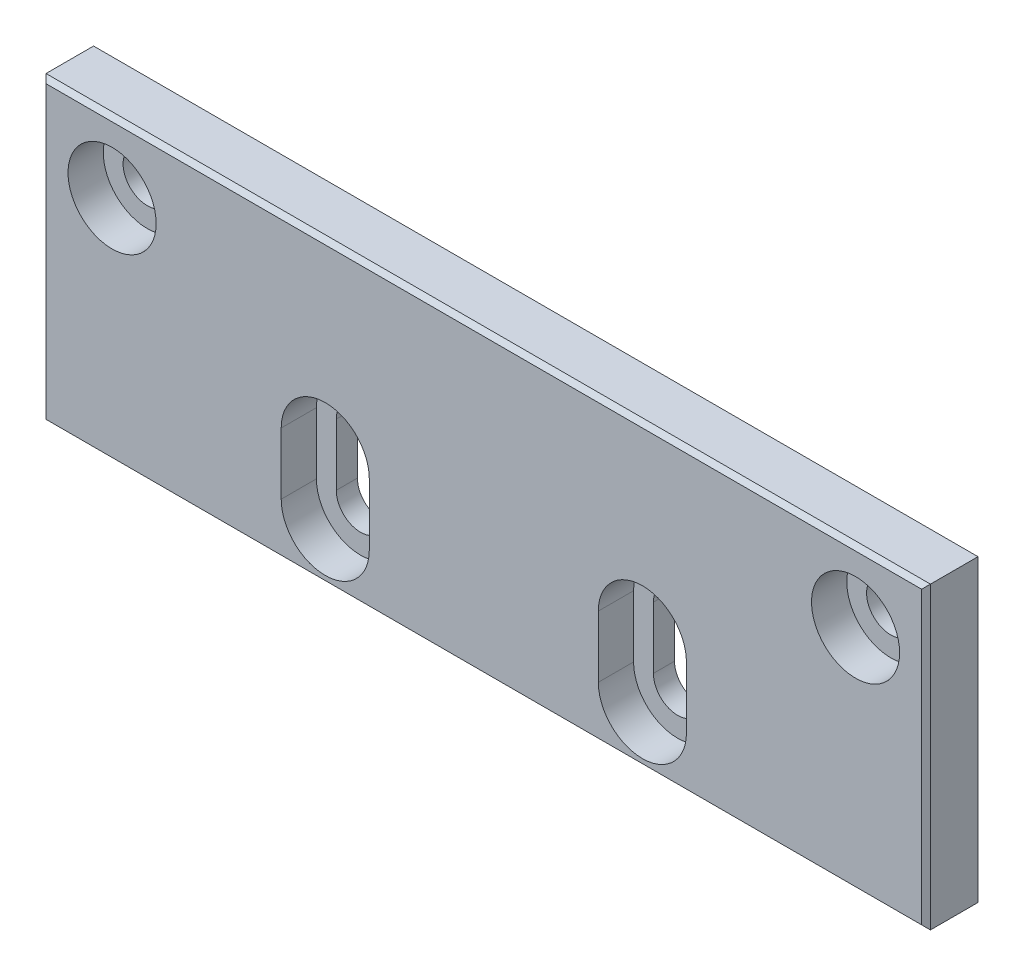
ISO-10303-21;
HEADER;
FILE_DESCRIPTION(('STEP AP214'),'2;1');
FILE_NAME('part.step','',(''),(''),'','','');
FILE_SCHEMA(('AUTOMOTIVE_DESIGN { 1 0 10303 214 1 1 1 1 }'));
ENDSEC;
DATA;
#1=APPLICATION_CONTEXT('core data for automotive mechanical design processes');
#2=APPLICATION_PROTOCOL_DEFINITION('international standard','automotive_design',2000,#1);
#3=PRODUCT_CONTEXT('',#1,'mechanical');
#4=PRODUCT('Part','Part','',(#3));
#5=PRODUCT_RELATED_PRODUCT_CATEGORY('part','',(#4));
#6=PRODUCT_DEFINITION_FORMATION('','',#4);
#7=PRODUCT_DEFINITION_CONTEXT('part definition',#1,'design');
#8=PRODUCT_DEFINITION('design','',#6,#7);
#9=PRODUCT_DEFINITION_SHAPE('','',#8);
#10=(LENGTH_UNIT() NAMED_UNIT(*) SI_UNIT(.MILLI.,.METRE.));
#11=(NAMED_UNIT(*) PLANE_ANGLE_UNIT() SI_UNIT($,.RADIAN.));
#12=(NAMED_UNIT(*) SI_UNIT($,.STERADIAN.) SOLID_ANGLE_UNIT());
#13=UNCERTAINTY_MEASURE_WITH_UNIT(LENGTH_MEASURE(1.E-05),#10,'distance_accuracy_value','');
#14=(GEOMETRIC_REPRESENTATION_CONTEXT(3) GLOBAL_UNCERTAINTY_ASSIGNED_CONTEXT((#13)) GLOBAL_UNIT_ASSIGNED_CONTEXT((#10,
#11,#12)) REPRESENTATION_CONTEXT('',''));
#15=CARTESIAN_POINT('',(0.,0.,0.));
#16=DIRECTION('',(0.,0.,1.));
#17=DIRECTION('',(1.,0.,0.));
#18=AXIS2_PLACEMENT_3D('',#15,#16,#17);
#19=CARTESIAN_POINT('',(50.2,-45.,6.4));
#20=DIRECTION('',(-1.,0.,0.));
#21=DIRECTION('',(0.,0.,1.));
#22=AXIS2_PLACEMENT_3D('',#19,#20,#21);
#23=PLANE('',#22);
#24=DIRECTION('',(0.,0.,-1.));
#25=VECTOR('',#24,1.);
#26=CARTESIAN_POINT('',(50.2,-45.,6.4));
#27=LINE('',#26,#25);
#28=CARTESIAN_POINT('',(50.2,-45.,5.90000000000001));
#29=VERTEX_POINT('',#28);
#30=CARTESIAN_POINT('',(50.2,-45.,0.5));
#31=VERTEX_POINT('',#30);
#32=EDGE_CURVE('E366',#29,#31,#27,.T.);
#33=ORIENTED_EDGE('',*,*,#32,.T.);
#34=DIRECTION('',(0.,1.,0.));
#35=VECTOR('',#34,1.);
#36=CARTESIAN_POINT('',(50.2,-45.,0.5));
#37=LINE('',#36,#35);
#38=CARTESIAN_POINT('',(50.2,-11.,0.5));
#39=VERTEX_POINT('',#38);
#40=EDGE_CURVE('E403',#31,#39,#37,.T.);
#41=ORIENTED_EDGE('',*,*,#40,.T.);
#42=DIRECTION('',(0.,0.,-1.));
#43=VECTOR('',#42,1.);
#44=CARTESIAN_POINT('',(50.2,-11.,6.4));
#45=LINE('',#44,#43);
#46=CARTESIAN_POINT('',(50.2,-11.,5.90000000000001));
#47=VERTEX_POINT('',#46);
#48=EDGE_CURVE('E375',#47,#39,#45,.T.);
#49=ORIENTED_EDGE('',*,*,#48,.F.);
#50=DIRECTION('',(0.,-1.,0.));
#51=VECTOR('',#50,1.);
#52=CARTESIAN_POINT('',(50.2,-45.,5.90000000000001));
#53=LINE('',#52,#51);
#54=EDGE_CURVE('E401',#47,#29,#53,.T.);
#55=ORIENTED_EDGE('',*,*,#54,.T.);
#56=EDGE_LOOP('',(#33,#41,#49,#55));
#57=FACE_BOUND('',#56,.T.);
#58=ADVANCED_FACE('F30',(#57),#23,.F.);
#59=CARTESIAN_POINT('',(50.2,-11.,6.4));
#60=DIRECTION('',(0.,-1.,0.));
#61=DIRECTION('',(0.,0.,-1.));
#62=AXIS2_PLACEMENT_3D('',#59,#60,#61);
#63=PLANE('',#62);
#64=ORIENTED_EDGE('',*,*,#48,.T.);
#65=DIRECTION('',(-1.,0.,0.));
#66=VECTOR('',#65,1.);
#67=CARTESIAN_POINT('',(50.2,-11.,0.5));
#68=LINE('',#67,#66);
#69=CARTESIAN_POINT('',(-50.2,-11.,0.5));
#70=VERTEX_POINT('',#69);
#71=EDGE_CURVE('E380',#39,#70,#68,.T.);
#72=ORIENTED_EDGE('',*,*,#71,.T.);
#73=DIRECTION('',(0.,0.,-1.));
#74=VECTOR('',#73,1.);
#75=CARTESIAN_POINT('',(-50.2,-11.,6.4));
#76=LINE('',#75,#74);
#77=CARTESIAN_POINT('',(-50.2,-11.,5.90000000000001));
#78=VERTEX_POINT('',#77);
#79=EDGE_CURVE('E372',#78,#70,#76,.T.);
#80=ORIENTED_EDGE('',*,*,#79,.F.);
#81=DIRECTION('',(1.,0.,0.));
#82=VECTOR('',#81,1.);
#83=CARTESIAN_POINT('',(50.2,-11.,5.90000000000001));
#84=LINE('',#83,#82);
#85=EDGE_CURVE('E378',#78,#47,#84,.T.);
#86=ORIENTED_EDGE('',*,*,#85,.T.);
#87=EDGE_LOOP('',(#64,#72,#80,#86));
#88=FACE_BOUND('',#87,.T.);
#89=ADVANCED_FACE('F433',(#88),#63,.F.);
#90=CARTESIAN_POINT('',(-50.2,-45.,6.4));
#91=DIRECTION('',(1.,0.,0.));
#92=DIRECTION('',(0.,0.,-1.));
#93=AXIS2_PLACEMENT_3D('',#90,#91,#92);
#94=PLANE('',#93);
#95=ORIENTED_EDGE('',*,*,#79,.T.);
#96=DIRECTION('',(0.,-1.,0.));
#97=VECTOR('',#96,1.);
#98=CARTESIAN_POINT('',(-50.2,-45.,0.5));
#99=LINE('',#98,#97);
#100=CARTESIAN_POINT('',(-50.2,-45.,0.5));
#101=VERTEX_POINT('',#100);
#102=EDGE_CURVE('E394',#70,#101,#99,.T.);
#103=ORIENTED_EDGE('',*,*,#102,.T.);
#104=DIRECTION('',(0.,0.,-1.));
#105=VECTOR('',#104,1.);
#106=CARTESIAN_POINT('',(-50.2,-45.,6.4));
#107=LINE('',#106,#105);
#108=CARTESIAN_POINT('',(-50.2,-45.,5.90000000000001));
#109=VERTEX_POINT('',#108);
#110=EDGE_CURVE('E369',#109,#101,#107,.T.);
#111=ORIENTED_EDGE('',*,*,#110,.F.);
#112=DIRECTION('',(0.,1.,0.));
#113=VECTOR('',#112,1.);
#114=CARTESIAN_POINT('',(-50.2,-11.,5.90000000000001));
#115=LINE('',#114,#113);
#116=EDGE_CURVE('E392',#109,#78,#115,.T.);
#117=ORIENTED_EDGE('',*,*,#116,.T.);
#118=EDGE_LOOP('',(#95,#103,#111,#117));
#119=FACE_BOUND('',#118,.T.);
#120=ADVANCED_FACE('F449',(#119),#94,.F.);
#121=CARTESIAN_POINT('',(50.2,-45.,6.4));
#122=DIRECTION('',(0.,1.,0.));
#123=DIRECTION('',(0.,0.,1.));
#124=AXIS2_PLACEMENT_3D('',#121,#122,#123);
#125=PLANE('',#124);
#126=ORIENTED_EDGE('',*,*,#110,.T.);
#127=DIRECTION('',(1.,0.,0.));
#128=VECTOR('',#127,1.);
#129=CARTESIAN_POINT('',(50.2,-45.,0.5));
#130=LINE('',#129,#128);
#131=EDGE_CURVE('E399',#101,#31,#130,.T.);
#132=ORIENTED_EDGE('',*,*,#131,.T.);
#133=ORIENTED_EDGE('',*,*,#32,.F.);
#134=DIRECTION('',(-1.,0.,0.));
#135=VECTOR('',#134,1.);
#136=CARTESIAN_POINT('',(-50.2,-45.,5.90000000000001));
#137=LINE('',#136,#135);
#138=EDGE_CURVE('E396',#29,#109,#137,.T.);
#139=ORIENTED_EDGE('',*,*,#138,.T.);
#140=EDGE_LOOP('',(#126,#132,#133,#139));
#141=FACE_BOUND('',#140,.T.);
#142=ADVANCED_FACE('F453',(#141),#125,.F.);
#143=CARTESIAN_POINT('',(50.2,-11.,6.4));
#144=DIRECTION('',(0.,0.,1.));
#145=DIRECTION('',(1.,0.,0.));
#146=AXIS2_PLACEMENT_3D('',#143,#144,#145);
#147=PLANE('',#146);
#148=CARTESIAN_POINT('',(-18.,-39.,6.4));
#149=DIRECTION('',(0.,0.,1.));
#150=DIRECTION('',(-1.,0.,0.));
#151=AXIS2_PLACEMENT_3D('',#148,#149,#150);
#152=CIRCLE('',#151,5.);
#153=CARTESIAN_POINT('',(-23.,-39.,6.4));
#154=VERTEX_POINT('',#153);
#155=CARTESIAN_POINT('',(-13.,-39.,6.4));
#156=VERTEX_POINT('',#155);
#157=EDGE_CURVE('E252',#154,#156,#152,.T.);
#158=ORIENTED_EDGE('',*,*,#157,.F.);
#159=DIRECTION('',(0.,-1.,0.));
#160=VECTOR('',#159,1.);
#161=CARTESIAN_POINT('',(-23.,-32.,6.4));
#162=LINE('',#161,#160);
#163=CARTESIAN_POINT('',(-23.,-32.,6.4));
#164=VERTEX_POINT('',#163);
#165=EDGE_CURVE('E266',#164,#154,#162,.T.);
#166=ORIENTED_EDGE('',*,*,#165,.F.);
#167=CARTESIAN_POINT('',(-18.,-32.,6.4));
#168=DIRECTION('',(0.,0.,1.));
#169=DIRECTION('',(-1.,0.,0.));
#170=AXIS2_PLACEMENT_3D('',#167,#168,#169);
#171=CIRCLE('',#170,5.);
#172=CARTESIAN_POINT('',(-13.,-32.,6.4));
#173=VERTEX_POINT('',#172);
#174=EDGE_CURVE('E263',#173,#164,#171,.T.);
#175=ORIENTED_EDGE('',*,*,#174,.F.);
#176=DIRECTION('',(0.,1.,0.));
#177=VECTOR('',#176,1.);
#178=CARTESIAN_POINT('',(-13.,-32.,6.4));
#179=LINE('',#178,#177);
#180=EDGE_CURVE('E260',#156,#173,#179,.T.);
#181=ORIENTED_EDGE('',*,*,#180,.F.);
#182=EDGE_LOOP('',(#158,#166,#175,#181));
#183=FACE_BOUND('',#182,.T.);
#184=CARTESIAN_POINT('',(18.,-32.,6.4));
#185=DIRECTION('',(0.,0.,1.));
#186=DIRECTION('',(1.,0.,0.));
#187=AXIS2_PLACEMENT_3D('',#184,#185,#186);
#188=CIRCLE('',#187,5.);
#189=CARTESIAN_POINT('',(23.,-32.,6.4));
#190=VERTEX_POINT('',#189);
#191=CARTESIAN_POINT('',(13.,-32.,6.4));
#192=VERTEX_POINT('',#191);
#193=EDGE_CURVE('E284',#190,#192,#188,.T.);
#194=ORIENTED_EDGE('',*,*,#193,.F.);
#195=DIRECTION('',(0.,1.,0.));
#196=VECTOR('',#195,1.);
#197=CARTESIAN_POINT('',(23.,-32.,6.4));
#198=LINE('',#197,#196);
#199=CARTESIAN_POINT('',(23.,-39.,6.4));
#200=VERTEX_POINT('',#199);
#201=EDGE_CURVE('E298',#200,#190,#198,.T.);
#202=ORIENTED_EDGE('',*,*,#201,.F.);
#203=CARTESIAN_POINT('',(18.,-39.,6.4));
#204=DIRECTION('',(0.,0.,1.));
#205=DIRECTION('',(1.,0.,0.));
#206=AXIS2_PLACEMENT_3D('',#203,#204,#205);
#207=CIRCLE('',#206,5.);
#208=CARTESIAN_POINT('',(13.,-39.,6.4));
#209=VERTEX_POINT('',#208);
#210=EDGE_CURVE('E295',#209,#200,#207,.T.);
#211=ORIENTED_EDGE('',*,*,#210,.F.);
#212=DIRECTION('',(0.,-1.,0.));
#213=VECTOR('',#212,1.);
#214=CARTESIAN_POINT('',(13.,-32.,6.4));
#215=LINE('',#214,#213);
#216=EDGE_CURVE('E292',#192,#209,#215,.T.);
#217=ORIENTED_EDGE('',*,*,#216,.F.);
#218=EDGE_LOOP('',(#194,#202,#211,#217));
#219=FACE_BOUND('',#218,.T.);
#220=CARTESIAN_POINT('',(42.2,-19.,6.4));
#221=DIRECTION('',(0.,0.,1.));
#222=DIRECTION('',(1.,0.,0.));
#223=AXIS2_PLACEMENT_3D('',#220,#221,#222);
#224=CIRCLE('',#223,5.);
#225=CARTESIAN_POINT('',(47.2,-19.,6.4));
#226=VERTEX_POINT('',#225);
#227=EDGE_CURVE('E331',#226,#226,#224,.T.);
#228=ORIENTED_EDGE('',*,*,#227,.F.);
#229=EDGE_LOOP('',(#228));
#230=FACE_BOUND('',#229,.T.);
#231=CARTESIAN_POINT('',(-42.2,-19.,6.4));
#232=DIRECTION('',(0.,0.,1.));
#233=DIRECTION('',(1.,0.,0.));
#234=AXIS2_PLACEMENT_3D('',#231,#232,#233);
#235=CIRCLE('',#234,5.);
#236=CARTESIAN_POINT('',(-37.2,-19.,6.4));
#237=VERTEX_POINT('',#236);
#238=EDGE_CURVE('E343',#237,#237,#235,.T.);
#239=ORIENTED_EDGE('',*,*,#238,.F.);
#240=EDGE_LOOP('',(#239));
#241=FACE_BOUND('',#240,.T.);
#242=DIRECTION('',(0.,-1.,0.));
#243=VECTOR('',#242,1.);
#244=CARTESIAN_POINT('',(-49.7,-45.,6.4));
#245=LINE('',#244,#243);
#246=CARTESIAN_POINT('',(-49.7,-11.5,6.4));
#247=VERTEX_POINT('',#246);
#248=CARTESIAN_POINT('',(-49.7,-44.5,6.4));
#249=VERTEX_POINT('',#248);
#250=EDGE_CURVE('E37',#247,#249,#245,.T.);
#251=ORIENTED_EDGE('',*,*,#250,.T.);
#252=DIRECTION('',(1.,0.,0.));
#253=VECTOR('',#252,1.);
#254=CARTESIAN_POINT('',(50.2,-44.5,6.4));
#255=LINE('',#254,#253);
#256=CARTESIAN_POINT('',(49.7,-44.5,6.4));
#257=VERTEX_POINT('',#256);
#258=EDGE_CURVE('E11',#249,#257,#255,.T.);
#259=ORIENTED_EDGE('',*,*,#258,.T.);
#260=DIRECTION('',(0.,1.,0.));
#261=VECTOR('',#260,1.);
#262=CARTESIAN_POINT('',(49.7,-11.,6.4));
#263=LINE('',#262,#261);
#264=CARTESIAN_POINT('',(49.7,-11.5,6.4));
#265=VERTEX_POINT('',#264);
#266=EDGE_CURVE('E405',#257,#265,#263,.T.);
#267=ORIENTED_EDGE('',*,*,#266,.T.);
#268=DIRECTION('',(-1.,0.,0.));
#269=VECTOR('',#268,1.);
#270=CARTESIAN_POINT('',(-50.2,-11.5,6.4));
#271=LINE('',#270,#269);
#272=EDGE_CURVE('E407',#265,#247,#271,.T.);
#273=ORIENTED_EDGE('',*,*,#272,.T.);
#274=EDGE_LOOP('',(#251,#259,#267,#273));
#275=FACE_BOUND('',#274,.T.);
#276=ADVANCED_FACE('F411',(#183,#219,#230,#241,#275),#147,.T.);
#277=CARTESIAN_POINT('',(50.2,-11.,0.));
#278=DIRECTION('',(0.,0.,1.));
#279=DIRECTION('',(1.,0.,0.));
#280=AXIS2_PLACEMENT_3D('',#277,#278,#279);
#281=PLANE('',#280);
#282=DIRECTION('',(0.,-1.,0.));
#283=VECTOR('',#282,1.);
#284=CARTESIAN_POINT('',(-20.75,-39.,0.));
#285=LINE('',#284,#283);
#286=CARTESIAN_POINT('',(-20.75,-32.,0.));
#287=VERTEX_POINT('',#286);
#288=CARTESIAN_POINT('',(-20.75,-39.,0.));
#289=VERTEX_POINT('',#288);
#290=EDGE_CURVE('E219',#287,#289,#285,.T.);
#291=ORIENTED_EDGE('',*,*,#290,.T.);
#292=CARTESIAN_POINT('',(-18.,-39.,0.));
#293=DIRECTION('',(0.,0.,1.));
#294=DIRECTION('',(-1.,0.,0.));
#295=AXIS2_PLACEMENT_3D('',#292,#293,#294);
#296=CIRCLE('',#295,2.75);
#297=CARTESIAN_POINT('',(-15.25,-39.,0.));
#298=VERTEX_POINT('',#297);
#299=EDGE_CURVE('E210',#289,#298,#296,.T.);
#300=ORIENTED_EDGE('',*,*,#299,.T.);
#301=DIRECTION('',(0.,1.,0.));
#302=VECTOR('',#301,1.);
#303=CARTESIAN_POINT('',(-15.25,-32.,0.));
#304=LINE('',#303,#302);
#305=CARTESIAN_POINT('',(-15.25,-32.,0.));
#306=VERTEX_POINT('',#305);
#307=EDGE_CURVE('E216',#298,#306,#304,.T.);
#308=ORIENTED_EDGE('',*,*,#307,.T.);
#309=CARTESIAN_POINT('',(-18.,-32.,0.));
#310=DIRECTION('',(0.,0.,1.));
#311=DIRECTION('',(-1.,0.,0.));
#312=AXIS2_PLACEMENT_3D('',#309,#310,#311);
#313=CIRCLE('',#312,2.75);
#314=EDGE_CURVE('E44',#306,#287,#313,.T.);
#315=ORIENTED_EDGE('',*,*,#314,.T.);
#316=EDGE_LOOP('',(#291,#300,#308,#315));
#317=FACE_BOUND('',#316,.T.);
#318=DIRECTION('',(0.,1.,0.));
#319=VECTOR('',#318,1.);
#320=CARTESIAN_POINT('',(20.75,-39.,0.));
#321=LINE('',#320,#319);
#322=CARTESIAN_POINT('',(20.75,-39.,0.));
#323=VERTEX_POINT('',#322);
#324=CARTESIAN_POINT('',(20.75,-32.,0.));
#325=VERTEX_POINT('',#324);
#326=EDGE_CURVE('E246',#323,#325,#321,.T.);
#327=ORIENTED_EDGE('',*,*,#326,.T.);
#328=CARTESIAN_POINT('',(18.,-32.,0.));
#329=DIRECTION('',(0.,0.,1.));
#330=DIRECTION('',(1.,0.,0.));
#331=AXIS2_PLACEMENT_3D('',#328,#329,#330);
#332=CIRCLE('',#331,2.75);
#333=CARTESIAN_POINT('',(15.25,-32.,0.));
#334=VERTEX_POINT('',#333);
#335=EDGE_CURVE('E237',#325,#334,#332,.T.);
#336=ORIENTED_EDGE('',*,*,#335,.T.);
#337=DIRECTION('',(0.,-1.,0.));
#338=VECTOR('',#337,1.);
#339=CARTESIAN_POINT('',(15.25,-32.,0.));
#340=LINE('',#339,#338);
#341=CARTESIAN_POINT('',(15.25,-39.,0.));
#342=VERTEX_POINT('',#341);
#343=EDGE_CURVE('E240',#334,#342,#340,.T.);
#344=ORIENTED_EDGE('',*,*,#343,.T.);
#345=CARTESIAN_POINT('',(18.,-39.,0.));
#346=DIRECTION('',(0.,0.,1.));
#347=DIRECTION('',(1.,0.,0.));
#348=AXIS2_PLACEMENT_3D('',#345,#346,#347);
#349=CIRCLE('',#348,2.75);
#350=EDGE_CURVE('E243',#342,#323,#349,.T.);
#351=ORIENTED_EDGE('',*,*,#350,.T.);
#352=EDGE_LOOP('',(#327,#336,#344,#351));
#353=FACE_BOUND('',#352,.T.);
#354=CARTESIAN_POINT('',(42.2,-19.,0.));
#355=DIRECTION('',(0.,0.,1.));
#356=DIRECTION('',(1.,0.,0.));
#357=AXIS2_PLACEMENT_3D('',#354,#355,#356);
#358=CIRCLE('',#357,2.75);
#359=CARTESIAN_POINT('',(44.95,-19.,0.));
#360=VERTEX_POINT('',#359);
#361=EDGE_CURVE('E316',#360,#360,#358,.T.);
#362=ORIENTED_EDGE('',*,*,#361,.T.);
#363=EDGE_LOOP('',(#362));
#364=FACE_BOUND('',#363,.T.);
#365=CARTESIAN_POINT('',(-42.2,-19.,0.));
#366=DIRECTION('',(0.,0.,1.));
#367=DIRECTION('',(1.,0.,0.));
#368=AXIS2_PLACEMENT_3D('',#365,#366,#367);
#369=CIRCLE('',#368,2.75);
#370=CARTESIAN_POINT('',(-39.45,-19.,0.));
#371=VERTEX_POINT('',#370);
#372=EDGE_CURVE('E334',#371,#371,#369,.T.);
#373=ORIENTED_EDGE('',*,*,#372,.T.);
#374=EDGE_LOOP('',(#373));
#375=FACE_BOUND('',#374,.T.);
#376=DIRECTION('',(0.,1.,0.));
#377=VECTOR('',#376,1.);
#378=CARTESIAN_POINT('',(-49.7,-11.,0.));
#379=LINE('',#378,#377);
#380=CARTESIAN_POINT('',(-49.7,-44.5,0.));
#381=VERTEX_POINT('',#380);
#382=CARTESIAN_POINT('',(-49.7,-11.5,0.));
#383=VERTEX_POINT('',#382);
#384=EDGE_CURVE('E387',#381,#383,#379,.T.);
#385=ORIENTED_EDGE('',*,*,#384,.T.);
#386=DIRECTION('',(1.,0.,0.));
#387=VECTOR('',#386,1.);
#388=CARTESIAN_POINT('',(50.2,-11.5,0.));
#389=LINE('',#388,#387);
#390=CARTESIAN_POINT('',(49.7,-11.5,0.));
#391=VERTEX_POINT('',#390);
#392=EDGE_CURVE('E389',#383,#391,#389,.T.);
#393=ORIENTED_EDGE('',*,*,#392,.T.);
#394=DIRECTION('',(0.,-1.,0.));
#395=VECTOR('',#394,1.);
#396=CARTESIAN_POINT('',(49.7,-11.,0.));
#397=LINE('',#396,#395);
#398=CARTESIAN_POINT('',(49.7,-44.5,0.));
#399=VERTEX_POINT('',#398);
#400=EDGE_CURVE('E383',#391,#399,#397,.T.);
#401=ORIENTED_EDGE('',*,*,#400,.T.);
#402=DIRECTION('',(-1.,0.,0.));
#403=VECTOR('',#402,1.);
#404=CARTESIAN_POINT('',(50.2,-44.5,0.));
#405=LINE('',#404,#403);
#406=EDGE_CURVE('E385',#399,#381,#405,.T.);
#407=ORIENTED_EDGE('',*,*,#406,.T.);
#408=EDGE_LOOP('',(#385,#393,#401,#407));
#409=FACE_BOUND('',#408,.T.);
#410=ADVANCED_FACE('F462',(#317,#353,#364,#375,#409),#281,.F.);
#411=CARTESIAN_POINT('',(50.2,-45.,0.5));
#412=DIRECTION('',(0.,0.707106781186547,0.707106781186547));
#413=DIRECTION('',(0.,-0.707106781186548,0.707106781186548));
#414=AXIS2_PLACEMENT_3D('',#411,#412,#413);
#415=PLANE('',#414);
#416=DIRECTION('',(0.577350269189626,0.577350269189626,-0.577350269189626));
#417=VECTOR('',#416,1.);
#418=CARTESIAN_POINT('',(-16.7333333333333,-11.5333333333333,-32.9666666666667));
#419=LINE('',#418,#417);
#420=EDGE_CURVE('E360',#381,#101,#419,.F.);
#421=ORIENTED_EDGE('',*,*,#420,.F.);
#422=ORIENTED_EDGE('',*,*,#406,.F.);
#423=DIRECTION('',(-0.577350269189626,0.577350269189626,-0.577350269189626));
#424=VECTOR('',#423,1.);
#425=CARTESIAN_POINT('',(50.2,-45.,0.5));
#426=LINE('',#425,#424);
#427=EDGE_CURVE('E363',#31,#399,#426,.T.);
#428=ORIENTED_EDGE('',*,*,#427,.F.);
#429=ORIENTED_EDGE('',*,*,#131,.F.);
#430=EDGE_LOOP('',(#421,#422,#428,#429));
#431=FACE_BOUND('',#430,.T.);
#432=ADVANCED_FACE('F456',(#431),#415,.F.);
#433=CARTESIAN_POINT('',(50.2,-45.,0.5));
#434=DIRECTION('',(-0.707106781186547,0.,0.707106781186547));
#435=DIRECTION('',(0.707106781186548,0.,0.707106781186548));
#436=AXIS2_PLACEMENT_3D('',#433,#434,#435);
#437=PLANE('',#436);
#438=ORIENTED_EDGE('',*,*,#427,.T.);
#439=ORIENTED_EDGE('',*,*,#400,.F.);
#440=DIRECTION('',(0.577350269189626,0.577350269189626,0.577350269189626));
#441=VECTOR('',#440,1.);
#442=CARTESIAN_POINT('',(38.8666666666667,-22.3333333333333,-10.8333333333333));
#443=LINE('',#442,#441);
#444=EDGE_CURVE('E358',#39,#391,#443,.F.);
#445=ORIENTED_EDGE('',*,*,#444,.F.);
#446=ORIENTED_EDGE('',*,*,#40,.F.);
#447=EDGE_LOOP('',(#438,#439,#445,#446));
#448=FACE_BOUND('',#447,.T.);
#449=ADVANCED_FACE('F440',(#448),#437,.F.);
#450=CARTESIAN_POINT('',(-50.2,-45.,0.5));
#451=DIRECTION('',(0.707106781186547,0.,0.707106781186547));
#452=DIRECTION('',(0.707106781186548,0.,-0.707106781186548));
#453=AXIS2_PLACEMENT_3D('',#450,#451,#452);
#454=PLANE('',#453);
#455=ORIENTED_EDGE('',*,*,#420,.T.);
#456=ORIENTED_EDGE('',*,*,#102,.F.);
#457=DIRECTION('',(0.577350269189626,-0.577350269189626,-0.577350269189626));
#458=VECTOR('',#457,1.);
#459=CARTESIAN_POINT('',(-38.8666666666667,-22.3333333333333,-10.8333333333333));
#460=LINE('',#459,#458);
#461=EDGE_CURVE('E356',#383,#70,#460,.F.);
#462=ORIENTED_EDGE('',*,*,#461,.F.);
#463=ORIENTED_EDGE('',*,*,#384,.F.);
#464=EDGE_LOOP('',(#455,#456,#462,#463));
#465=FACE_BOUND('',#464,.T.);
#466=ADVANCED_FACE('F460',(#465),#454,.F.);
#467=CARTESIAN_POINT('',(50.2,-11.,0.5));
#468=DIRECTION('',(0.,-0.707106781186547,0.707106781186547));
#469=DIRECTION('',(0.,-0.707106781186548,-0.707106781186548));
#470=AXIS2_PLACEMENT_3D('',#467,#468,#469);
#471=PLANE('',#470);
#472=ORIENTED_EDGE('',*,*,#444,.T.);
#473=ORIENTED_EDGE('',*,*,#392,.F.);
#474=ORIENTED_EDGE('',*,*,#461,.T.);
#475=ORIENTED_EDGE('',*,*,#71,.F.);
#476=EDGE_LOOP('',(#472,#473,#474,#475));
#477=FACE_BOUND('',#476,.T.);
#478=ADVANCED_FACE('F445',(#477),#471,.F.);
#479=CARTESIAN_POINT('',(50.2,-11.5,6.4));
#480=DIRECTION('',(0.,0.707106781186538,0.707106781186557));
#481=DIRECTION('',(0.,-0.707106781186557,0.707106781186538));
#482=AXIS2_PLACEMENT_3D('',#479,#480,#481);
#483=PLANE('',#482);
#484=DIRECTION('',(-0.577350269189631,-0.577350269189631,0.577350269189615));
#485=VECTOR('',#484,1.);
#486=CARTESIAN_POINT('',(49.8666666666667,-11.3333333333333,6.23333333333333));
#487=LINE('',#486,#485);
#488=EDGE_CURVE('E350',#47,#265,#487,.T.);
#489=ORIENTED_EDGE('',*,*,#488,.F.);
#490=ORIENTED_EDGE('',*,*,#85,.F.);
#491=DIRECTION('',(0.577350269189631,-0.577350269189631,0.577350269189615));
#492=VECTOR('',#491,1.);
#493=CARTESIAN_POINT('',(-16.3999999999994,-44.8000000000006,39.6999999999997));
#494=LINE('',#493,#492);
#495=EDGE_CURVE('E353',#247,#78,#494,.F.);
#496=ORIENTED_EDGE('',*,*,#495,.F.);
#497=ORIENTED_EDGE('',*,*,#272,.F.);
#498=EDGE_LOOP('',(#489,#490,#496,#497));
#499=FACE_BOUND('',#498,.T.);
#500=ADVANCED_FACE('F428',(#499),#483,.T.);
#501=CARTESIAN_POINT('',(-49.7,-11.,6.4));
#502=DIRECTION('',(-0.707106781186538,0.,0.707106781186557));
#503=DIRECTION('',(0.707106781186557,0.,0.707106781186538));
#504=AXIS2_PLACEMENT_3D('',#501,#502,#503);
#505=PLANE('',#504);
#506=ORIENTED_EDGE('',*,*,#495,.T.);
#507=ORIENTED_EDGE('',*,*,#116,.F.);
#508=DIRECTION('',(0.577350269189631,0.577350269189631,0.577350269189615));
#509=VECTOR('',#508,1.);
#510=CARTESIAN_POINT('',(-38.5333333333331,-33.3333333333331,17.5666666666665));
#511=LINE('',#510,#509);
#512=EDGE_CURVE('E348',#249,#109,#511,.F.);
#513=ORIENTED_EDGE('',*,*,#512,.F.);
#514=ORIENTED_EDGE('',*,*,#250,.F.);
#515=EDGE_LOOP('',(#506,#507,#513,#514));
#516=FACE_BOUND('',#515,.T.);
#517=ADVANCED_FACE('F417',(#516),#505,.T.);
#518=CARTESIAN_POINT('',(49.7,-11.,6.4));
#519=DIRECTION('',(0.707106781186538,0.,0.707106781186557));
#520=DIRECTION('',(0.707106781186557,0.,-0.707106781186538));
#521=AXIS2_PLACEMENT_3D('',#518,#519,#520);
#522=PLANE('',#521);
#523=ORIENTED_EDGE('',*,*,#488,.T.);
#524=ORIENTED_EDGE('',*,*,#266,.F.);
#525=DIRECTION('',(0.577350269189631,-0.577350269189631,-0.577350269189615));
#526=VECTOR('',#525,1.);
#527=CARTESIAN_POINT('',(38.5333333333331,-33.3333333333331,17.5666666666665));
#528=LINE('',#527,#526);
#529=EDGE_CURVE('E346',#29,#257,#528,.F.);
#530=ORIENTED_EDGE('',*,*,#529,.F.);
#531=ORIENTED_EDGE('',*,*,#54,.F.);
#532=EDGE_LOOP('',(#523,#524,#530,#531));
#533=FACE_BOUND('',#532,.T.);
#534=ADVANCED_FACE('F425',(#533),#522,.T.);
#535=CARTESIAN_POINT('',(50.2,-44.5,6.4));
#536=DIRECTION('',(0.,-0.707106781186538,0.707106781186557));
#537=DIRECTION('',(0.,-0.707106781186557,-0.707106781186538));
#538=AXIS2_PLACEMENT_3D('',#535,#536,#537);
#539=PLANE('',#538);
#540=ORIENTED_EDGE('',*,*,#512,.T.);
#541=ORIENTED_EDGE('',*,*,#138,.F.);
#542=ORIENTED_EDGE('',*,*,#529,.T.);
#543=ORIENTED_EDGE('',*,*,#258,.F.);
#544=EDGE_LOOP('',(#540,#541,#542,#543));
#545=FACE_BOUND('',#544,.T.);
#546=ADVANCED_FACE('F420',(#545),#539,.T.);
#547=CARTESIAN_POINT('',(-42.2,-19.,6.4));
#548=DIRECTION('',(0.,0.,1.));
#549=DIRECTION('',(1.,0.,0.));
#550=AXIS2_PLACEMENT_3D('',#547,#548,#549);
#551=CYLINDRICAL_SURFACE('',#550,5.);
#552=CARTESIAN_POINT('',(-42.2,-19.,2.4));
#553=DIRECTION('',(0.,0.,1.));
#554=DIRECTION('',(1.,0.,0.));
#555=AXIS2_PLACEMENT_3D('',#552,#553,#554);
#556=CIRCLE('',#555,5.);
#557=CARTESIAN_POINT('',(-37.2,-19.,2.4));
#558=VERTEX_POINT('',#557);
#559=EDGE_CURVE('E340',#558,#558,#556,.T.);
#560=ORIENTED_EDGE('',*,*,#559,.F.);
#561=EDGE_LOOP('',(#560));
#562=FACE_BOUND('',#561,.T.);
#563=ORIENTED_EDGE('',*,*,#238,.T.);
#564=EDGE_LOOP('',(#563));
#565=FACE_BOUND('',#564,.T.);
#566=ADVANCED_FACE('F699',(#562,#565),#551,.F.);
#567=CARTESIAN_POINT('',(-39.45,-19.,2.4));
#568=DIRECTION('',(0.,0.,-1.));
#569=DIRECTION('',(-1.,0.,0.));
#570=AXIS2_PLACEMENT_3D('',#567,#568,#569);
#571=PLANE('',#570);
#572=CARTESIAN_POINT('',(-42.2,-19.,2.4));
#573=DIRECTION('',(0.,0.,1.));
#574=DIRECTION('',(1.,0.,0.));
#575=AXIS2_PLACEMENT_3D('',#572,#573,#574);
#576=CIRCLE('',#575,2.75);
#577=CARTESIAN_POINT('',(-39.45,-19.,2.4));
#578=VERTEX_POINT('',#577);
#579=EDGE_CURVE('E337',#578,#578,#576,.T.);
#580=ORIENTED_EDGE('',*,*,#579,.F.);
#581=EDGE_LOOP('',(#580));
#582=FACE_BOUND('',#581,.T.);
#583=ORIENTED_EDGE('',*,*,#559,.T.);
#584=EDGE_LOOP('',(#583));
#585=FACE_BOUND('',#584,.T.);
#586=ADVANCED_FACE('F695',(#582,#585),#571,.F.);
#587=CARTESIAN_POINT('',(-42.2,-19.,6.4));
#588=DIRECTION('',(0.,0.,1.));
#589=DIRECTION('',(1.,0.,0.));
#590=AXIS2_PLACEMENT_3D('',#587,#588,#589);
#591=CYLINDRICAL_SURFACE('',#590,2.75);
#592=ORIENTED_EDGE('',*,*,#372,.F.);
#593=EDGE_LOOP('',(#592));
#594=FACE_BOUND('',#593,.T.);
#595=ORIENTED_EDGE('',*,*,#579,.T.);
#596=EDGE_LOOP('',(#595));
#597=FACE_BOUND('',#596,.T.);
#598=ADVANCED_FACE('F691',(#594,#597),#591,.F.);
#599=CARTESIAN_POINT('',(42.2,-19.,6.4));
#600=DIRECTION('',(0.,0.,1.));
#601=DIRECTION('',(1.,0.,0.));
#602=AXIS2_PLACEMENT_3D('',#599,#600,#601);
#603=CYLINDRICAL_SURFACE('',#602,5.);
#604=CARTESIAN_POINT('',(42.2,-19.,2.4));
#605=DIRECTION('',(0.,0.,1.));
#606=DIRECTION('',(1.,0.,0.));
#607=AXIS2_PLACEMENT_3D('',#604,#605,#606);
#608=CIRCLE('',#607,5.);
#609=CARTESIAN_POINT('',(47.2,-19.,2.4));
#610=VERTEX_POINT('',#609);
#611=EDGE_CURVE('E328',#610,#610,#608,.T.);
#612=ORIENTED_EDGE('',*,*,#611,.F.);
#613=EDGE_LOOP('',(#612));
#614=FACE_BOUND('',#613,.T.);
#615=ORIENTED_EDGE('',*,*,#227,.T.);
#616=EDGE_LOOP('',(#615));
#617=FACE_BOUND('',#616,.T.);
#618=ADVANCED_FACE('F687',(#614,#617),#603,.F.);
#619=CARTESIAN_POINT('',(44.95,-19.,2.4));
#620=DIRECTION('',(0.,0.,-1.));
#621=DIRECTION('',(-1.,0.,0.));
#622=AXIS2_PLACEMENT_3D('',#619,#620,#621);
#623=PLANE('',#622);
#624=CARTESIAN_POINT('',(42.2,-19.,2.4));
#625=DIRECTION('',(0.,0.,1.));
#626=DIRECTION('',(1.,0.,0.));
#627=AXIS2_PLACEMENT_3D('',#624,#625,#626);
#628=CIRCLE('',#627,2.75);
#629=CARTESIAN_POINT('',(44.95,-19.,2.4));
#630=VERTEX_POINT('',#629);
#631=EDGE_CURVE('E325',#630,#630,#628,.T.);
#632=ORIENTED_EDGE('',*,*,#631,.F.);
#633=EDGE_LOOP('',(#632));
#634=FACE_BOUND('',#633,.T.);
#635=ORIENTED_EDGE('',*,*,#611,.T.);
#636=EDGE_LOOP('',(#635));
#637=FACE_BOUND('',#636,.T.);
#638=ADVANCED_FACE('F683',(#634,#637),#623,.F.);
#639=CARTESIAN_POINT('',(42.2,-19.,6.4));
#640=DIRECTION('',(0.,0.,1.));
#641=DIRECTION('',(1.,0.,0.));
#642=AXIS2_PLACEMENT_3D('',#639,#640,#641);
#643=CYLINDRICAL_SURFACE('',#642,2.75);
#644=ORIENTED_EDGE('',*,*,#361,.F.);
#645=EDGE_LOOP('',(#644));
#646=FACE_BOUND('',#645,.T.);
#647=ORIENTED_EDGE('',*,*,#631,.T.);
#648=EDGE_LOOP('',(#647));
#649=FACE_BOUND('',#648,.T.);
#650=ADVANCED_FACE('F500',(#646,#649),#643,.F.);
#651=CARTESIAN_POINT('',(18.,-32.,2.4));
#652=DIRECTION('',(0.,0.,1.));
#653=DIRECTION('',(1.,0.,0.));
#654=AXIS2_PLACEMENT_3D('',#651,#652,#653);
#655=CYLINDRICAL_SURFACE('',#654,5.);
#656=ORIENTED_EDGE('',*,*,#193,.T.);
#657=DIRECTION('',(0.,0.,1.));
#658=VECTOR('',#657,1.);
#659=CARTESIAN_POINT('',(13.,-32.,2.4));
#660=LINE('',#659,#658);
#661=CARTESIAN_POINT('',(13.,-32.,2.4));
#662=VERTEX_POINT('',#661);
#663=EDGE_CURVE('E313',#662,#192,#660,.T.);
#664=ORIENTED_EDGE('',*,*,#663,.F.);
#665=CARTESIAN_POINT('',(18.,-32.,2.4));
#666=DIRECTION('',(0.,0.,1.));
#667=DIRECTION('',(1.,0.,0.));
#668=AXIS2_PLACEMENT_3D('',#665,#666,#667);
#669=CIRCLE('',#668,5.);
#670=CARTESIAN_POINT('',(23.,-32.,2.4));
#671=VERTEX_POINT('',#670);
#672=EDGE_CURVE('E301',#671,#662,#669,.T.);
#673=ORIENTED_EDGE('',*,*,#672,.F.);
#674=DIRECTION('',(0.,0.,1.));
#675=VECTOR('',#674,1.);
#676=CARTESIAN_POINT('',(23.,-32.,2.4));
#677=LINE('',#676,#675);
#678=EDGE_CURVE('E314',#671,#190,#677,.T.);
#679=ORIENTED_EDGE('',*,*,#678,.T.);
#680=EDGE_LOOP('',(#656,#664,#673,#679));
#681=FACE_BOUND('',#680,.T.);
#682=ADVANCED_FACE('F505',(#681),#655,.F.);
#683=CARTESIAN_POINT('',(23.,-32.,2.4));
#684=DIRECTION('',(1.,0.,0.));
#685=DIRECTION('',(0.,1.,0.));
#686=AXIS2_PLACEMENT_3D('',#683,#684,#685);
#687=PLANE('',#686);
#688=ORIENTED_EDGE('',*,*,#201,.T.);
#689=ORIENTED_EDGE('',*,*,#678,.F.);
#690=DIRECTION('',(0.,1.,0.));
#691=VECTOR('',#690,1.);
#692=CARTESIAN_POINT('',(23.,-32.,2.4));
#693=LINE('',#692,#691);
#694=CARTESIAN_POINT('',(23.,-39.,2.4));
#695=VERTEX_POINT('',#694);
#696=EDGE_CURVE('E310',#695,#671,#693,.T.);
#697=ORIENTED_EDGE('',*,*,#696,.F.);
#698=DIRECTION('',(0.,0.,1.));
#699=VECTOR('',#698,1.);
#700=CARTESIAN_POINT('',(23.,-39.,2.4));
#701=LINE('',#700,#699);
#702=EDGE_CURVE('E317',#695,#200,#701,.T.);
#703=ORIENTED_EDGE('',*,*,#702,.T.);
#704=EDGE_LOOP('',(#688,#689,#697,#703));
#705=FACE_BOUND('',#704,.T.);
#706=ADVANCED_FACE('F510',(#705),#687,.F.);
#707=CARTESIAN_POINT('',(18.,-39.,2.4));
#708=DIRECTION('',(0.,0.,1.));
#709=DIRECTION('',(1.,0.,0.));
#710=AXIS2_PLACEMENT_3D('',#707,#708,#709);
#711=CYLINDRICAL_SURFACE('',#710,5.);
#712=ORIENTED_EDGE('',*,*,#210,.T.);
#713=ORIENTED_EDGE('',*,*,#702,.F.);
#714=CARTESIAN_POINT('',(18.,-39.,2.4));
#715=DIRECTION('',(0.,0.,1.));
#716=DIRECTION('',(1.,0.,0.));
#717=AXIS2_PLACEMENT_3D('',#714,#715,#716);
#718=CIRCLE('',#717,5.);
#719=CARTESIAN_POINT('',(13.,-39.,2.4));
#720=VERTEX_POINT('',#719);
#721=EDGE_CURVE('E307',#720,#695,#718,.T.);
#722=ORIENTED_EDGE('',*,*,#721,.F.);
#723=DIRECTION('',(0.,0.,1.));
#724=VECTOR('',#723,1.);
#725=CARTESIAN_POINT('',(13.,-39.,2.4));
#726=LINE('',#725,#724);
#727=EDGE_CURVE('E319',#720,#209,#726,.T.);
#728=ORIENTED_EDGE('',*,*,#727,.T.);
#729=EDGE_LOOP('',(#712,#713,#722,#728));
#730=FACE_BOUND('',#729,.T.);
#731=ADVANCED_FACE('F520',(#730),#711,.F.);
#732=CARTESIAN_POINT('',(13.,-32.,2.4));
#733=DIRECTION('',(-1.,0.,0.));
#734=DIRECTION('',(0.,0.,1.));
#735=AXIS2_PLACEMENT_3D('',#732,#733,#734);
#736=PLANE('',#735);
#737=ORIENTED_EDGE('',*,*,#216,.T.);
#738=ORIENTED_EDGE('',*,*,#727,.F.);
#739=DIRECTION('',(0.,-1.,0.));
#740=VECTOR('',#739,1.);
#741=CARTESIAN_POINT('',(13.,-32.,2.4));
#742=LINE('',#741,#740);
#743=EDGE_CURVE('E304',#662,#720,#742,.T.);
#744=ORIENTED_EDGE('',*,*,#743,.F.);
#745=ORIENTED_EDGE('',*,*,#663,.T.);
#746=EDGE_LOOP('',(#737,#738,#744,#745));
#747=FACE_BOUND('',#746,.T.);
#748=ADVANCED_FACE('F530',(#747),#736,.F.);
#749=CARTESIAN_POINT('',(18.,-32.,2.4));
#750=DIRECTION('',(0.,0.,1.));
#751=DIRECTION('',(1.,0.,0.));
#752=AXIS2_PLACEMENT_3D('',#749,#750,#751);
#753=PLANE('',#752);
#754=CARTESIAN_POINT('',(18.,-32.,2.4));
#755=DIRECTION('',(0.,0.,1.));
#756=DIRECTION('',(1.,0.,0.));
#757=AXIS2_PLACEMENT_3D('',#754,#755,#756);
#758=CIRCLE('',#757,2.75);
#759=CARTESIAN_POINT('',(20.75,-32.,2.4));
#760=VERTEX_POINT('',#759);
#761=CARTESIAN_POINT('',(15.25,-32.,2.4));
#762=VERTEX_POINT('',#761);
#763=EDGE_CURVE('E224',#760,#762,#758,.T.);
#764=ORIENTED_EDGE('',*,*,#763,.F.);
#765=DIRECTION('',(0.,1.,0.));
#766=VECTOR('',#765,1.);
#767=CARTESIAN_POINT('',(20.75,-39.,2.4));
#768=LINE('',#767,#766);
#769=CARTESIAN_POINT('',(20.75,-39.,2.4));
#770=VERTEX_POINT('',#769);
#771=EDGE_CURVE('E234',#770,#760,#768,.T.);
#772=ORIENTED_EDGE('',*,*,#771,.F.);
#773=CARTESIAN_POINT('',(18.,-39.,2.4));
#774=DIRECTION('',(0.,0.,1.));
#775=DIRECTION('',(1.,0.,0.));
#776=AXIS2_PLACEMENT_3D('',#773,#774,#775);
#777=CIRCLE('',#776,2.75);
#778=CARTESIAN_POINT('',(15.25,-39.,2.4));
#779=VERTEX_POINT('',#778);
#780=EDGE_CURVE('E231',#779,#770,#777,.T.);
#781=ORIENTED_EDGE('',*,*,#780,.F.);
#782=DIRECTION('',(0.,-1.,0.));
#783=VECTOR('',#782,1.);
#784=CARTESIAN_POINT('',(15.25,-32.,2.4));
#785=LINE('',#784,#783);
#786=EDGE_CURVE('E228',#762,#779,#785,.T.);
#787=ORIENTED_EDGE('',*,*,#786,.F.);
#788=EDGE_LOOP('',(#764,#772,#781,#787));
#789=FACE_BOUND('',#788,.T.);
#790=ORIENTED_EDGE('',*,*,#672,.T.);
#791=ORIENTED_EDGE('',*,*,#743,.T.);
#792=ORIENTED_EDGE('',*,*,#721,.T.);
#793=ORIENTED_EDGE('',*,*,#696,.T.);
#794=EDGE_LOOP('',(#790,#791,#792,#793));
#795=FACE_BOUND('',#794,.T.);
#796=ADVANCED_FACE('F540',(#789,#795),#753,.T.);
#797=CARTESIAN_POINT('',(-18.,-39.,2.4));
#798=DIRECTION('',(0.,0.,1.));
#799=DIRECTION('',(1.,0.,0.));
#800=AXIS2_PLACEMENT_3D('',#797,#798,#799);
#801=CYLINDRICAL_SURFACE('',#800,5.);
#802=ORIENTED_EDGE('',*,*,#157,.T.);
#803=DIRECTION('',(0.,0.,1.));
#804=VECTOR('',#803,1.);
#805=CARTESIAN_POINT('',(-13.,-39.,2.4));
#806=LINE('',#805,#804);
#807=CARTESIAN_POINT('',(-13.,-39.,2.4));
#808=VERTEX_POINT('',#807);
#809=EDGE_CURVE('E281',#808,#156,#806,.T.);
#810=ORIENTED_EDGE('',*,*,#809,.F.);
#811=CARTESIAN_POINT('',(-18.,-39.,2.4));
#812=DIRECTION('',(0.,0.,1.));
#813=DIRECTION('',(-1.,0.,0.));
#814=AXIS2_PLACEMENT_3D('',#811,#812,#813);
#815=CIRCLE('',#814,5.);
#816=CARTESIAN_POINT('',(-23.,-39.,2.4));
#817=VERTEX_POINT('',#816);
#818=EDGE_CURVE('E269',#817,#808,#815,.T.);
#819=ORIENTED_EDGE('',*,*,#818,.F.);
#820=DIRECTION('',(0.,0.,1.));
#821=VECTOR('',#820,1.);
#822=CARTESIAN_POINT('',(-23.,-39.,2.4));
#823=LINE('',#822,#821);
#824=EDGE_CURVE('E282',#817,#154,#823,.T.);
#825=ORIENTED_EDGE('',*,*,#824,.T.);
#826=EDGE_LOOP('',(#802,#810,#819,#825));
#827=FACE_BOUND('',#826,.T.);
#828=ADVANCED_FACE('F548',(#827),#801,.F.);
#829=CARTESIAN_POINT('',(-23.,-32.,2.4));
#830=DIRECTION('',(-1.,0.,0.));
#831=DIRECTION('',(0.,-1.,0.));
#832=AXIS2_PLACEMENT_3D('',#829,#830,#831);
#833=PLANE('',#832);
#834=ORIENTED_EDGE('',*,*,#165,.T.);
#835=ORIENTED_EDGE('',*,*,#824,.F.);
#836=DIRECTION('',(0.,-1.,0.));
#837=VECTOR('',#836,1.);
#838=CARTESIAN_POINT('',(-23.,-32.,2.4));
#839=LINE('',#838,#837);
#840=CARTESIAN_POINT('',(-23.,-32.,2.4));
#841=VERTEX_POINT('',#840);
#842=EDGE_CURVE('E278',#841,#817,#839,.T.);
#843=ORIENTED_EDGE('',*,*,#842,.F.);
#844=DIRECTION('',(0.,0.,1.));
#845=VECTOR('',#844,1.);
#846=CARTESIAN_POINT('',(-23.,-32.,2.4));
#847=LINE('',#846,#845);
#848=EDGE_CURVE('E285',#841,#164,#847,.T.);
#849=ORIENTED_EDGE('',*,*,#848,.T.);
#850=EDGE_LOOP('',(#834,#835,#843,#849));
#851=FACE_BOUND('',#850,.T.);
#852=ADVANCED_FACE('F553',(#851),#833,.F.);
#853=CARTESIAN_POINT('',(-18.,-32.,2.4));
#854=DIRECTION('',(0.,0.,1.));
#855=DIRECTION('',(1.,0.,0.));
#856=AXIS2_PLACEMENT_3D('',#853,#854,#855);
#857=CYLINDRICAL_SURFACE('',#856,5.);
#858=ORIENTED_EDGE('',*,*,#174,.T.);
#859=ORIENTED_EDGE('',*,*,#848,.F.);
#860=CARTESIAN_POINT('',(-18.,-32.,2.4));
#861=DIRECTION('',(0.,0.,1.));
#862=DIRECTION('',(-1.,0.,0.));
#863=AXIS2_PLACEMENT_3D('',#860,#861,#862);
#864=CIRCLE('',#863,5.);
#865=CARTESIAN_POINT('',(-13.,-32.,2.4));
#866=VERTEX_POINT('',#865);
#867=EDGE_CURVE('E275',#866,#841,#864,.T.);
#868=ORIENTED_EDGE('',*,*,#867,.F.);
#869=DIRECTION('',(0.,0.,1.));
#870=VECTOR('',#869,1.);
#871=CARTESIAN_POINT('',(-13.,-32.,2.4));
#872=LINE('',#871,#870);
#873=EDGE_CURVE('E287',#866,#173,#872,.T.);
#874=ORIENTED_EDGE('',*,*,#873,.T.);
#875=EDGE_LOOP('',(#858,#859,#868,#874));
#876=FACE_BOUND('',#875,.T.);
#877=ADVANCED_FACE('F563',(#876),#857,.F.);
#878=CARTESIAN_POINT('',(-13.,-32.,2.4));
#879=DIRECTION('',(1.,0.,0.));
#880=DIRECTION('',(0.,1.,0.));
#881=AXIS2_PLACEMENT_3D('',#878,#879,#880);
#882=PLANE('',#881);
#883=ORIENTED_EDGE('',*,*,#180,.T.);
#884=ORIENTED_EDGE('',*,*,#873,.F.);
#885=DIRECTION('',(0.,1.,0.));
#886=VECTOR('',#885,1.);
#887=CARTESIAN_POINT('',(-13.,-32.,2.4));
#888=LINE('',#887,#886);
#889=EDGE_CURVE('E272',#808,#866,#888,.T.);
#890=ORIENTED_EDGE('',*,*,#889,.F.);
#891=ORIENTED_EDGE('',*,*,#809,.T.);
#892=EDGE_LOOP('',(#883,#884,#890,#891));
#893=FACE_BOUND('',#892,.T.);
#894=ADVANCED_FACE('F573',(#893),#882,.F.);
#895=CARTESIAN_POINT('',(-18.,-39.,2.4));
#896=DIRECTION('',(0.,0.,-1.));
#897=DIRECTION('',(-1.,0.,0.));
#898=AXIS2_PLACEMENT_3D('',#895,#896,#897);
#899=PLANE('',#898);
#900=DIRECTION('',(0.,1.,0.));
#901=VECTOR('',#900,1.);
#902=CARTESIAN_POINT('',(-15.25,-32.,2.4));
#903=LINE('',#902,#901);
#904=CARTESIAN_POINT('',(-15.25,-39.,2.4));
#905=VERTEX_POINT('',#904);
#906=CARTESIAN_POINT('',(-15.25,-32.,2.4));
#907=VERTEX_POINT('',#906);
#908=EDGE_CURVE('E201',#905,#907,#903,.T.);
#909=ORIENTED_EDGE('',*,*,#908,.F.);
#910=CARTESIAN_POINT('',(-18.,-39.,2.4));
#911=DIRECTION('',(0.,0.,1.));
#912=DIRECTION('',(-1.,0.,0.));
#913=AXIS2_PLACEMENT_3D('',#910,#911,#912);
#914=CIRCLE('',#913,2.75);
#915=CARTESIAN_POINT('',(-20.75,-39.,2.4));
#916=VERTEX_POINT('',#915);
#917=EDGE_CURVE('E52',#916,#905,#914,.T.);
#918=ORIENTED_EDGE('',*,*,#917,.F.);
#919=DIRECTION('',(0.,-1.,0.));
#920=VECTOR('',#919,1.);
#921=CARTESIAN_POINT('',(-20.75,-39.,2.4));
#922=LINE('',#921,#920);
#923=CARTESIAN_POINT('',(-20.75,-32.,2.4));
#924=VERTEX_POINT('',#923);
#925=EDGE_CURVE('E208',#924,#916,#922,.T.);
#926=ORIENTED_EDGE('',*,*,#925,.F.);
#927=CARTESIAN_POINT('',(-18.,-32.,2.4));
#928=DIRECTION('',(0.,0.,1.));
#929=DIRECTION('',(-1.,0.,0.));
#930=AXIS2_PLACEMENT_3D('',#927,#928,#929);
#931=CIRCLE('',#930,2.75);
#932=EDGE_CURVE('E192',#907,#924,#931,.T.);
#933=ORIENTED_EDGE('',*,*,#932,.F.);
#934=EDGE_LOOP('',(#909,#918,#926,#933));
#935=FACE_BOUND('',#934,.T.);
#936=ORIENTED_EDGE('',*,*,#818,.T.);
#937=ORIENTED_EDGE('',*,*,#889,.T.);
#938=ORIENTED_EDGE('',*,*,#867,.T.);
#939=ORIENTED_EDGE('',*,*,#842,.T.);
#940=EDGE_LOOP('',(#936,#937,#938,#939));
#941=FACE_BOUND('',#940,.T.);
#942=ADVANCED_FACE('F205',(#935,#941),#899,.F.);
#943=CARTESIAN_POINT('',(18.,-32.,0.));
#944=DIRECTION('',(0.,0.,1.));
#945=DIRECTION('',(1.,0.,0.));
#946=AXIS2_PLACEMENT_3D('',#943,#944,#945);
#947=CYLINDRICAL_SURFACE('',#946,2.75);
#948=ORIENTED_EDGE('',*,*,#763,.T.);
#949=DIRECTION('',(0.,0.,1.));
#950=VECTOR('',#949,1.);
#951=CARTESIAN_POINT('',(15.25,-32.,0.));
#952=LINE('',#951,#950);
#953=EDGE_CURVE('E249',#334,#762,#952,.T.);
#954=ORIENTED_EDGE('',*,*,#953,.F.);
#955=ORIENTED_EDGE('',*,*,#335,.F.);
#956=DIRECTION('',(0.,0.,1.));
#957=VECTOR('',#956,1.);
#958=CARTESIAN_POINT('',(20.75,-32.,0.));
#959=LINE('',#958,#957);
#960=EDGE_CURVE('E250',#325,#760,#959,.T.);
#961=ORIENTED_EDGE('',*,*,#960,.T.);
#962=EDGE_LOOP('',(#948,#954,#955,#961));
#963=FACE_BOUND('',#962,.T.);
#964=ADVANCED_FACE('F603',(#963),#947,.F.);
#965=CARTESIAN_POINT('',(20.75,-39.,0.));
#966=DIRECTION('',(1.,0.,0.));
#967=DIRECTION('',(0.,1.,0.));
#968=AXIS2_PLACEMENT_3D('',#965,#966,#967);
#969=PLANE('',#968);
#970=ORIENTED_EDGE('',*,*,#771,.T.);
#971=ORIENTED_EDGE('',*,*,#960,.F.);
#972=ORIENTED_EDGE('',*,*,#326,.F.);
#973=DIRECTION('',(0.,0.,1.));
#974=VECTOR('',#973,1.);
#975=CARTESIAN_POINT('',(20.75,-39.,0.));
#976=LINE('',#975,#974);
#977=EDGE_CURVE('E253',#323,#770,#976,.T.);
#978=ORIENTED_EDGE('',*,*,#977,.T.);
#979=EDGE_LOOP('',(#970,#971,#972,#978));
#980=FACE_BOUND('',#979,.T.);
#981=ADVANCED_FACE('F612',(#980),#969,.F.);
#982=CARTESIAN_POINT('',(18.,-39.,0.));
#983=DIRECTION('',(0.,0.,1.));
#984=DIRECTION('',(1.,0.,0.));
#985=AXIS2_PLACEMENT_3D('',#982,#983,#984);
#986=CYLINDRICAL_SURFACE('',#985,2.75);
#987=ORIENTED_EDGE('',*,*,#780,.T.);
#988=ORIENTED_EDGE('',*,*,#977,.F.);
#989=ORIENTED_EDGE('',*,*,#350,.F.);
#990=DIRECTION('',(0.,0.,1.));
#991=VECTOR('',#990,1.);
#992=CARTESIAN_POINT('',(15.25,-39.,0.));
#993=LINE('',#992,#991);
#994=EDGE_CURVE('E255',#342,#779,#993,.T.);
#995=ORIENTED_EDGE('',*,*,#994,.T.);
#996=EDGE_LOOP('',(#987,#988,#989,#995));
#997=FACE_BOUND('',#996,.T.);
#998=ADVANCED_FACE('F622',(#997),#986,.F.);
#999=CARTESIAN_POINT('',(15.25,-32.,0.));
#1000=DIRECTION('',(-1.,0.,0.));
#1001=DIRECTION('',(0.,-1.,0.));
#1002=AXIS2_PLACEMENT_3D('',#999,#1000,#1001);
#1003=PLANE('',#1002);
#1004=ORIENTED_EDGE('',*,*,#786,.T.);
#1005=ORIENTED_EDGE('',*,*,#994,.F.);
#1006=ORIENTED_EDGE('',*,*,#343,.F.);
#1007=ORIENTED_EDGE('',*,*,#953,.T.);
#1008=EDGE_LOOP('',(#1004,#1005,#1006,#1007));
#1009=FACE_BOUND('',#1008,.T.);
#1010=ADVANCED_FACE('F632',(#1009),#1003,.F.);
#1011=CARTESIAN_POINT('',(-18.,-39.,0.));
#1012=DIRECTION('',(0.,0.,1.));
#1013=DIRECTION('',(1.,0.,0.));
#1014=AXIS2_PLACEMENT_3D('',#1011,#1012,#1013);
#1015=CYLINDRICAL_SURFACE('',#1014,2.75);
#1016=ORIENTED_EDGE('',*,*,#917,.T.);
#1017=DIRECTION('',(0.,0.,1.));
#1018=VECTOR('',#1017,1.);
#1019=CARTESIAN_POINT('',(-15.25,-39.,0.));
#1020=LINE('',#1019,#1018);
#1021=EDGE_CURVE('E198',#298,#905,#1020,.T.);
#1022=ORIENTED_EDGE('',*,*,#1021,.F.);
#1023=ORIENTED_EDGE('',*,*,#299,.F.);
#1024=DIRECTION('',(0.,0.,1.));
#1025=VECTOR('',#1024,1.);
#1026=CARTESIAN_POINT('',(-20.75,-39.,0.));
#1027=LINE('',#1026,#1025);
#1028=EDGE_CURVE('E222',#289,#916,#1027,.T.);
#1029=ORIENTED_EDGE('',*,*,#1028,.T.);
#1030=EDGE_LOOP('',(#1016,#1022,#1023,#1029));
#1031=FACE_BOUND('',#1030,.T.);
#1032=ADVANCED_FACE('F642',(#1031),#1015,.F.);
#1033=CARTESIAN_POINT('',(-20.75,-39.,0.));
#1034=DIRECTION('',(-1.,0.,0.));
#1035=DIRECTION('',(0.,-1.,0.));
#1036=AXIS2_PLACEMENT_3D('',#1033,#1034,#1035);
#1037=PLANE('',#1036);
#1038=ORIENTED_EDGE('',*,*,#925,.T.);
#1039=ORIENTED_EDGE('',*,*,#1028,.F.);
#1040=ORIENTED_EDGE('',*,*,#290,.F.);
#1041=DIRECTION('',(0.,0.,1.));
#1042=VECTOR('',#1041,1.);
#1043=CARTESIAN_POINT('',(-20.75,-32.,0.));
#1044=LINE('',#1043,#1042);
#1045=EDGE_CURVE('E197',#287,#924,#1044,.T.);
#1046=ORIENTED_EDGE('',*,*,#1045,.T.);
#1047=EDGE_LOOP('',(#1038,#1039,#1040,#1046));
#1048=FACE_BOUND('',#1047,.T.);
#1049=ADVANCED_FACE('F652',(#1048),#1037,.F.);
#1050=CARTESIAN_POINT('',(-18.,-32.,0.));
#1051=DIRECTION('',(0.,0.,1.));
#1052=DIRECTION('',(1.,0.,0.));
#1053=AXIS2_PLACEMENT_3D('',#1050,#1051,#1052);
#1054=CYLINDRICAL_SURFACE('',#1053,2.75);
#1055=ORIENTED_EDGE('',*,*,#932,.T.);
#1056=ORIENTED_EDGE('',*,*,#1045,.F.);
#1057=ORIENTED_EDGE('',*,*,#314,.F.);
#1058=DIRECTION('',(0.,0.,1.));
#1059=VECTOR('',#1058,1.);
#1060=CARTESIAN_POINT('',(-15.25,-32.,0.));
#1061=LINE('',#1060,#1059);
#1062=EDGE_CURVE('E188',#306,#907,#1061,.T.);
#1063=ORIENTED_EDGE('',*,*,#1062,.T.);
#1064=EDGE_LOOP('',(#1055,#1056,#1057,#1063));
#1065=FACE_BOUND('',#1064,.T.);
#1066=ADVANCED_FACE('F190',(#1065),#1054,.F.);
#1067=CARTESIAN_POINT('',(-15.25,-32.,0.));
#1068=DIRECTION('',(1.,0.,0.));
#1069=DIRECTION('',(0.,1.,0.));
#1070=AXIS2_PLACEMENT_3D('',#1067,#1068,#1069);
#1071=PLANE('',#1070);
#1072=ORIENTED_EDGE('',*,*,#908,.T.);
#1073=ORIENTED_EDGE('',*,*,#1062,.F.);
#1074=ORIENTED_EDGE('',*,*,#307,.F.);
#1075=ORIENTED_EDGE('',*,*,#1021,.T.);
#1076=EDGE_LOOP('',(#1072,#1073,#1074,#1075));
#1077=FACE_BOUND('',#1076,.T.);
#1078=ADVANCED_FACE('F202',(#1077),#1071,.F.);
#1079=CLOSED_SHELL('',(#58,#89,#120,#142,#276,#410,#432,#449,#466,#478,#500,#517,#534,#546,#566,
#586,#598,#618,#638,#650,#682,#706,#731,#748,#796,#828,#852,#877,#894,#942,#964,#981,#998,#1010,
#1032,#1049,#1066,#1078));
#1080=MANIFOLD_SOLID_BREP('B2',#1079);
#1081=ADVANCED_BREP_SHAPE_REPRESENTATION('',(#18,#1080),#14);
#1082=SHAPE_DEFINITION_REPRESENTATION(#9,#1081);
ENDSEC;
END-ISO-10303-21;
